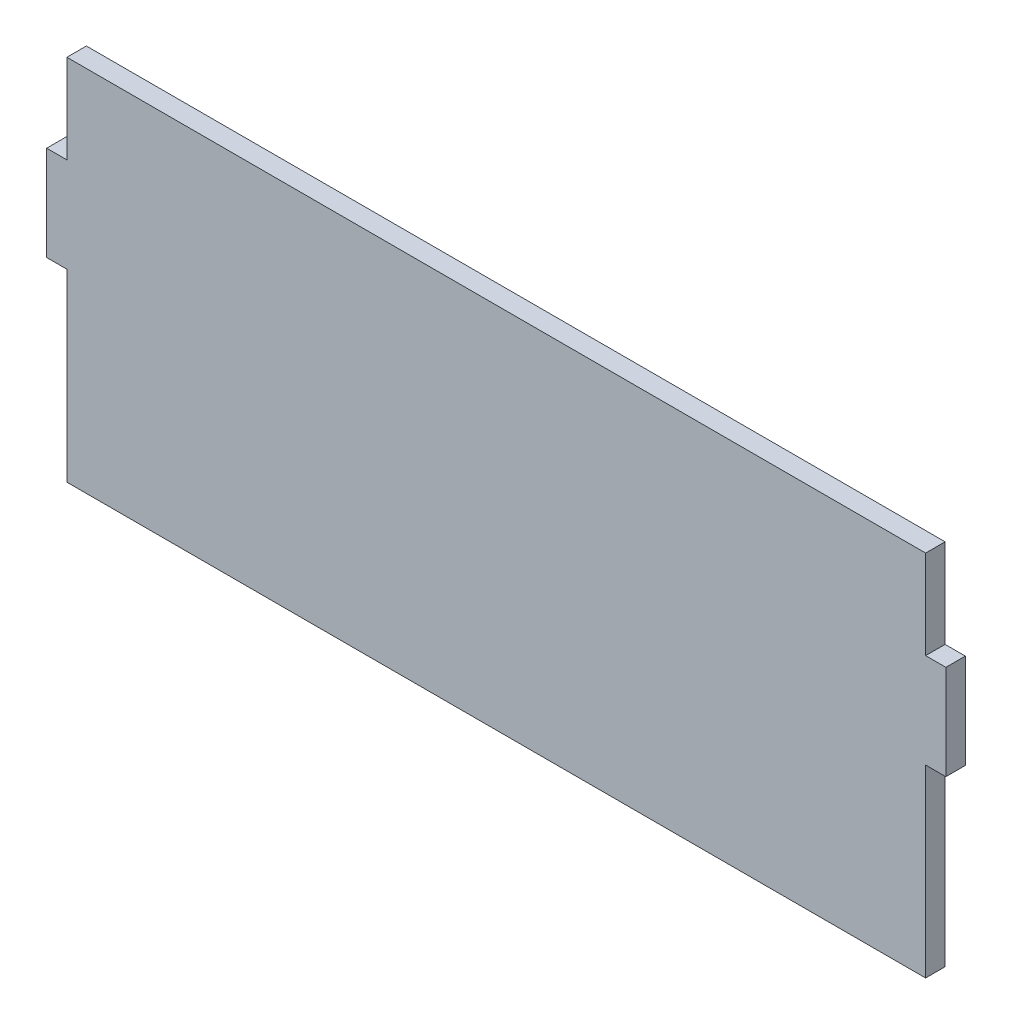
from build123d import *

# Parameters (mm, degrees)
SALIENTE_EXTRUIR1_DEPTH = 2.6


with BuildPart() as part:
    # Croquis1 → Saliente-Extruir1 (new body)
    with BuildSketch(Plane.XY):
        Polygon((-72.736724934, 8.907436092), (-72.736724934, -2.233188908), (-72.736724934, -3.733147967), (-70.036724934, -3.733147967), (-70.036724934, -28.348202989), (44.563275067, -28.348202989), (44.563275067, -3.733147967), (47.263275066, -3.733147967), (47.263275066, -2.233188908), (47.263275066, 8.907436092), (44.563275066, 8.907436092), (44.563275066, 20.766811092), (-44.28372779, 20.766811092), (-70.036724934, 20.766811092), (-70.036724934, 8.907436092), align=None)
    extrude(amount=SALIENTE_EXTRUIR1_DEPTH)


solid = part.part
